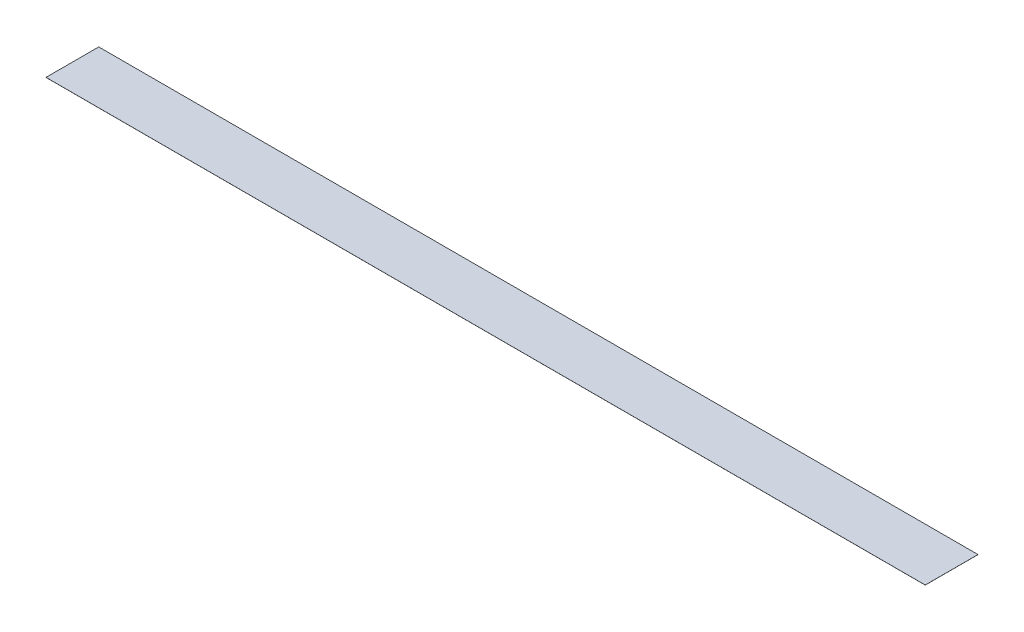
from build123d import *

# Parameters (mm, degrees)
SKETCH1_W      = 12700
SKETCH1_H      = 762
EXTRUDE1_DEPTH = 1


with BuildPart() as part:
    # Sketch1 → Extrude1 (new body)
    with BuildSketch(Plane(origin=(0, 0, 0), x_dir=(1, 0, 0), z_dir=(0, 1, 0))):
        with Locations((6350, 0)):
            Rectangle(SKETCH1_W, SKETCH1_H)
    extrude(amount=-EXTRUDE1_DEPTH)


solid = part.part
